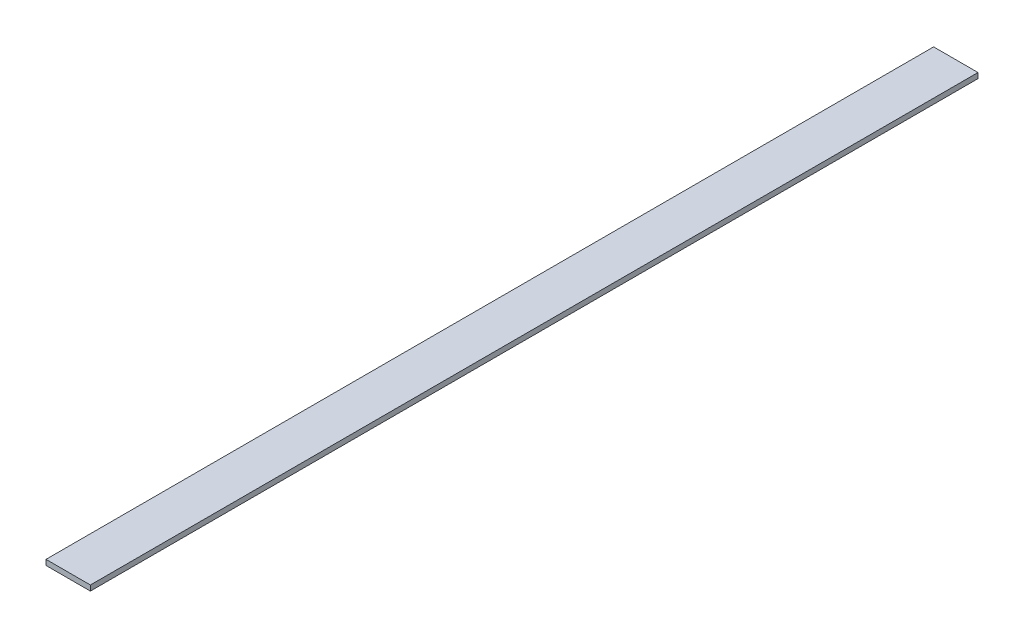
ISO-10303-21;
HEADER;
FILE_DESCRIPTION(('STEP AP214'),'2;1');
FILE_NAME('part.step','',(''),(''),'','','');
FILE_SCHEMA(('AUTOMOTIVE_DESIGN { 1 0 10303 214 1 1 1 1 }'));
ENDSEC;
DATA;
#1=APPLICATION_CONTEXT('core data for automotive mechanical design processes');
#2=APPLICATION_PROTOCOL_DEFINITION('international standard','automotive_design',2000,#1);
#3=PRODUCT_CONTEXT('',#1,'mechanical');
#4=PRODUCT('Part','Part','',(#3));
#5=PRODUCT_RELATED_PRODUCT_CATEGORY('part','',(#4));
#6=PRODUCT_DEFINITION_FORMATION('','',#4);
#7=PRODUCT_DEFINITION_CONTEXT('part definition',#1,'design');
#8=PRODUCT_DEFINITION('design','',#6,#7);
#9=PRODUCT_DEFINITION_SHAPE('','',#8);
#10=(LENGTH_UNIT() NAMED_UNIT(*) SI_UNIT(.MILLI.,.METRE.));
#11=(NAMED_UNIT(*) PLANE_ANGLE_UNIT() SI_UNIT($,.RADIAN.));
#12=(NAMED_UNIT(*) SI_UNIT($,.STERADIAN.) SOLID_ANGLE_UNIT());
#13=UNCERTAINTY_MEASURE_WITH_UNIT(LENGTH_MEASURE(1.E-05),#10,'distance_accuracy_value','');
#14=(GEOMETRIC_REPRESENTATION_CONTEXT(3) GLOBAL_UNCERTAINTY_ASSIGNED_CONTEXT((#13)) GLOBAL_UNIT_ASSIGNED_CONTEXT((#10,
#11,#12)) REPRESENTATION_CONTEXT('',''));
#15=CARTESIAN_POINT('',(0.,0.,0.));
#16=DIRECTION('',(0.,0.,1.));
#17=DIRECTION('',(1.,0.,0.));
#18=AXIS2_PLACEMENT_3D('',#15,#16,#17);
#19=CARTESIAN_POINT('',(12.5,0.,0.));
#20=DIRECTION('',(-1.,0.,0.));
#21=DIRECTION('',(0.,0.,1.));
#22=AXIS2_PLACEMENT_3D('',#19,#20,#21);
#23=PLANE('',#22);
#24=DIRECTION('',(0.,-1.,0.));
#25=VECTOR('',#24,1.);
#26=CARTESIAN_POINT('',(12.5,1.5,0.));
#27=LINE('',#26,#25);
#28=CARTESIAN_POINT('',(12.5,3.,0.));
#29=VERTEX_POINT('',#28);
#30=CARTESIAN_POINT('',(12.5,0.,0.));
#31=VERTEX_POINT('',#30);
#32=EDGE_CURVE('E51',#29,#31,#27,.T.);
#33=ORIENTED_EDGE('',*,*,#32,.F.);
#34=DIRECTION('',(0.,0.,-1.));
#35=VECTOR('',#34,1.);
#36=CARTESIAN_POINT('',(12.5,3.,250.));
#37=LINE('',#36,#35);
#38=CARTESIAN_POINT('',(12.5,3.,500.));
#39=VERTEX_POINT('',#38);
#40=EDGE_CURVE('E66',#39,#29,#37,.T.);
#41=ORIENTED_EDGE('',*,*,#40,.F.);
#42=DIRECTION('',(0.,-1.,0.));
#43=VECTOR('',#42,1.);
#44=CARTESIAN_POINT('',(12.5,1.5,500.));
#45=LINE('',#44,#43);
#46=CARTESIAN_POINT('',(12.5,0.,500.));
#47=VERTEX_POINT('',#46);
#48=EDGE_CURVE('E18',#39,#47,#45,.T.);
#49=ORIENTED_EDGE('',*,*,#48,.T.);
#50=DIRECTION('',(0.,0.,1.));
#51=VECTOR('',#50,1.);
#52=CARTESIAN_POINT('',(12.5,0.,250.));
#53=LINE('',#52,#51);
#54=EDGE_CURVE('E56',#31,#47,#53,.T.);
#55=ORIENTED_EDGE('',*,*,#54,.F.);
#56=EDGE_LOOP('',(#33,#41,#49,#55));
#57=FACE_BOUND('',#56,.T.);
#58=ADVANCED_FACE('F14',(#57),#23,.F.);
#59=CARTESIAN_POINT('',(12.5,0.,500.));
#60=DIRECTION('',(0.,0.,-1.));
#61=DIRECTION('',(-1.,0.,0.));
#62=AXIS2_PLACEMENT_3D('',#59,#60,#61);
#63=PLANE('',#62);
#64=DIRECTION('',(-1.,0.,0.));
#65=VECTOR('',#64,1.);
#66=CARTESIAN_POINT('',(0.,0.,500.));
#67=LINE('',#66,#65);
#68=CARTESIAN_POINT('',(-12.5,0.,500.));
#69=VERTEX_POINT('',#68);
#70=EDGE_CURVE('E61',#47,#69,#67,.T.);
#71=ORIENTED_EDGE('',*,*,#70,.F.);
#72=ORIENTED_EDGE('',*,*,#48,.F.);
#73=DIRECTION('',(1.,0.,0.));
#74=VECTOR('',#73,1.);
#75=CARTESIAN_POINT('',(0.,3.,500.));
#76=LINE('',#75,#74);
#77=CARTESIAN_POINT('',(-12.5,3.,500.));
#78=VERTEX_POINT('',#77);
#79=EDGE_CURVE('E79',#78,#39,#76,.T.);
#80=ORIENTED_EDGE('',*,*,#79,.F.);
#81=DIRECTION('',(0.,-1.,0.));
#82=VECTOR('',#81,1.);
#83=CARTESIAN_POINT('',(-12.5,1.5,500.));
#84=LINE('',#83,#82);
#85=EDGE_CURVE('E72',#78,#69,#84,.T.);
#86=ORIENTED_EDGE('',*,*,#85,.T.);
#87=EDGE_LOOP('',(#71,#72,#80,#86));
#88=FACE_BOUND('',#87,.T.);
#89=ADVANCED_FACE('F71',(#88),#63,.F.);
#90=CARTESIAN_POINT('',(-12.5,0.,500.));
#91=DIRECTION('',(0.,-1.,0.));
#92=DIRECTION('',(0.,0.,-1.));
#93=AXIS2_PLACEMENT_3D('',#90,#91,#92);
#94=PLANE('',#93);
#95=ORIENTED_EDGE('',*,*,#70,.T.);
#96=DIRECTION('',(0.,0.,-1.));
#97=VECTOR('',#96,1.);
#98=CARTESIAN_POINT('',(-12.5,0.,250.));
#99=LINE('',#98,#97);
#100=CARTESIAN_POINT('',(-12.5,0.,0.));
#101=VERTEX_POINT('',#100);
#102=EDGE_CURVE('E82',#69,#101,#99,.T.);
#103=ORIENTED_EDGE('',*,*,#102,.T.);
#104=DIRECTION('',(-1.,0.,0.));
#105=VECTOR('',#104,1.);
#106=CARTESIAN_POINT('',(0.,0.,0.));
#107=LINE('',#106,#105);
#108=EDGE_CURVE('E63',#31,#101,#107,.T.);
#109=ORIENTED_EDGE('',*,*,#108,.F.);
#110=ORIENTED_EDGE('',*,*,#54,.T.);
#111=EDGE_LOOP('',(#95,#103,#109,#110));
#112=FACE_BOUND('',#111,.T.);
#113=ADVANCED_FACE('F58',(#112),#94,.T.);
#114=CARTESIAN_POINT('',(12.5,0.,0.));
#115=DIRECTION('',(0.,0.,-1.));
#116=DIRECTION('',(-1.,0.,0.));
#117=AXIS2_PLACEMENT_3D('',#114,#115,#116);
#118=PLANE('',#117);
#119=ORIENTED_EDGE('',*,*,#32,.T.);
#120=ORIENTED_EDGE('',*,*,#108,.T.);
#121=DIRECTION('',(0.,1.,0.));
#122=VECTOR('',#121,1.);
#123=CARTESIAN_POINT('',(-12.5,1.5,0.));
#124=LINE('',#123,#122);
#125=CARTESIAN_POINT('',(-12.5,3.,0.));
#126=VERTEX_POINT('',#125);
#127=EDGE_CURVE('E24',#101,#126,#124,.T.);
#128=ORIENTED_EDGE('',*,*,#127,.T.);
#129=DIRECTION('',(-1.,0.,0.));
#130=VECTOR('',#129,1.);
#131=CARTESIAN_POINT('',(0.,3.,0.));
#132=LINE('',#131,#130);
#133=EDGE_CURVE('E32',#29,#126,#132,.T.);
#134=ORIENTED_EDGE('',*,*,#133,.F.);
#135=EDGE_LOOP('',(#119,#120,#128,#134));
#136=FACE_BOUND('',#135,.T.);
#137=ADVANCED_FACE('F86',(#136),#118,.T.);
#138=CARTESIAN_POINT('',(12.5,3.,0.));
#139=DIRECTION('',(0.,1.,0.));
#140=DIRECTION('',(-1.,0.,0.));
#141=AXIS2_PLACEMENT_3D('',#138,#139,#140);
#142=PLANE('',#141);
#143=DIRECTION('',(0.,0.,1.));
#144=VECTOR('',#143,1.);
#145=CARTESIAN_POINT('',(-12.5,3.,250.));
#146=LINE('',#145,#144);
#147=EDGE_CURVE('E9',#126,#78,#146,.T.);
#148=ORIENTED_EDGE('',*,*,#147,.T.);
#149=ORIENTED_EDGE('',*,*,#79,.T.);
#150=ORIENTED_EDGE('',*,*,#40,.T.);
#151=ORIENTED_EDGE('',*,*,#133,.T.);
#152=EDGE_LOOP('',(#148,#149,#150,#151));
#153=FACE_BOUND('',#152,.T.);
#154=ADVANCED_FACE('F88',(#153),#142,.T.);
#155=CARTESIAN_POINT('',(-12.5,0.,500.));
#156=DIRECTION('',(1.,0.,0.));
#157=DIRECTION('',(0.,0.,-1.));
#158=AXIS2_PLACEMENT_3D('',#155,#156,#157);
#159=PLANE('',#158);
#160=ORIENTED_EDGE('',*,*,#127,.F.);
#161=ORIENTED_EDGE('',*,*,#102,.F.);
#162=ORIENTED_EDGE('',*,*,#85,.F.);
#163=ORIENTED_EDGE('',*,*,#147,.F.);
#164=EDGE_LOOP('',(#160,#161,#162,#163));
#165=FACE_BOUND('',#164,.T.);
#166=ADVANCED_FACE('F16',(#165),#159,.F.);
#167=CLOSED_SHELL('',(#58,#89,#113,#137,#154,#166));
#168=MANIFOLD_SOLID_BREP('B1',#167);
#169=ADVANCED_BREP_SHAPE_REPRESENTATION('',(#18,#168),#14);
#170=SHAPE_DEFINITION_REPRESENTATION(#9,#169);
ENDSEC;
END-ISO-10303-21;
